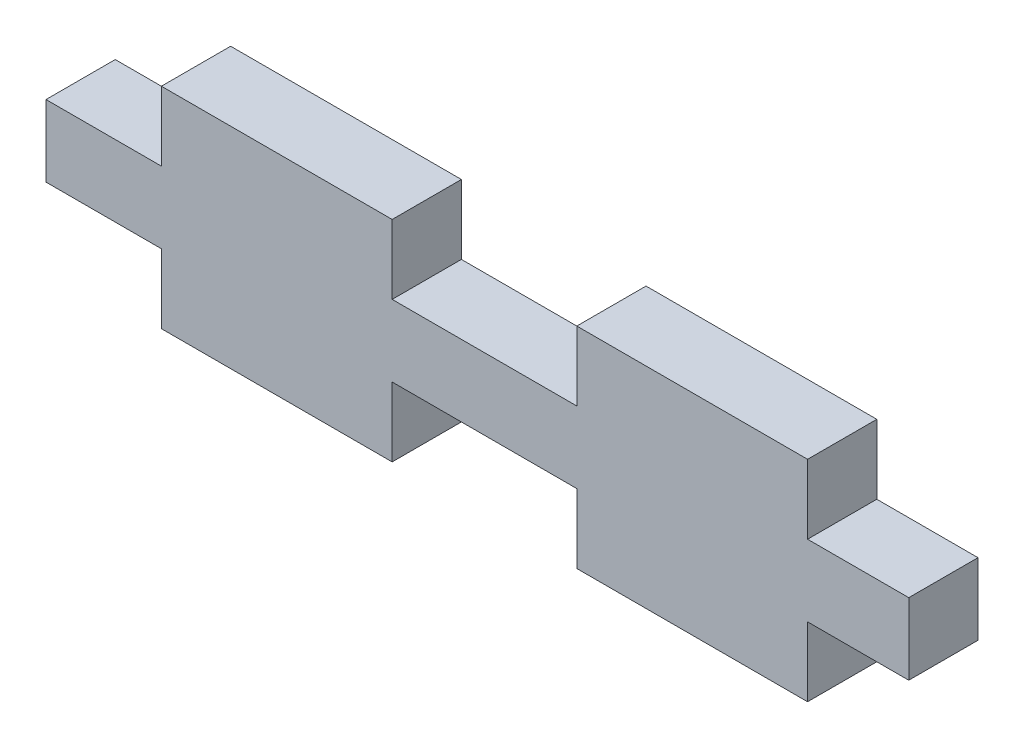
from build123d import *

# Parameters (mm, degrees)
BOSS_EXTRU_1_DEPTH = 3


with BuildPart() as part:
    # Esquisse1 → Boss.-Extru.1 (new body)
    with BuildSketch(Plane.XY):
        Polygon((-45.384651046, 0), (-40.384651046, 0), (-40.384651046, -3), (-30.384651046, -3), (-30.384651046, 0), (-22.384651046, 0), (-22.384651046, -3), (-12.384651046, -3), (-12.384651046, 0), (-8, 0), (-8, 3.1), (-12.384651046, 3.1), (-12.384651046, 6.1), (-22.384651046, 6.1), (-22.384651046, 3.1), (-30.384651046, 3.1), (-30.384651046, 6.1), (-40.384651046, 6.1), (-40.384651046, 3.1), (-45.384651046, 3.1), align=None)
    extrude(amount=BOSS_EXTRU_1_DEPTH)


solid = part.part
